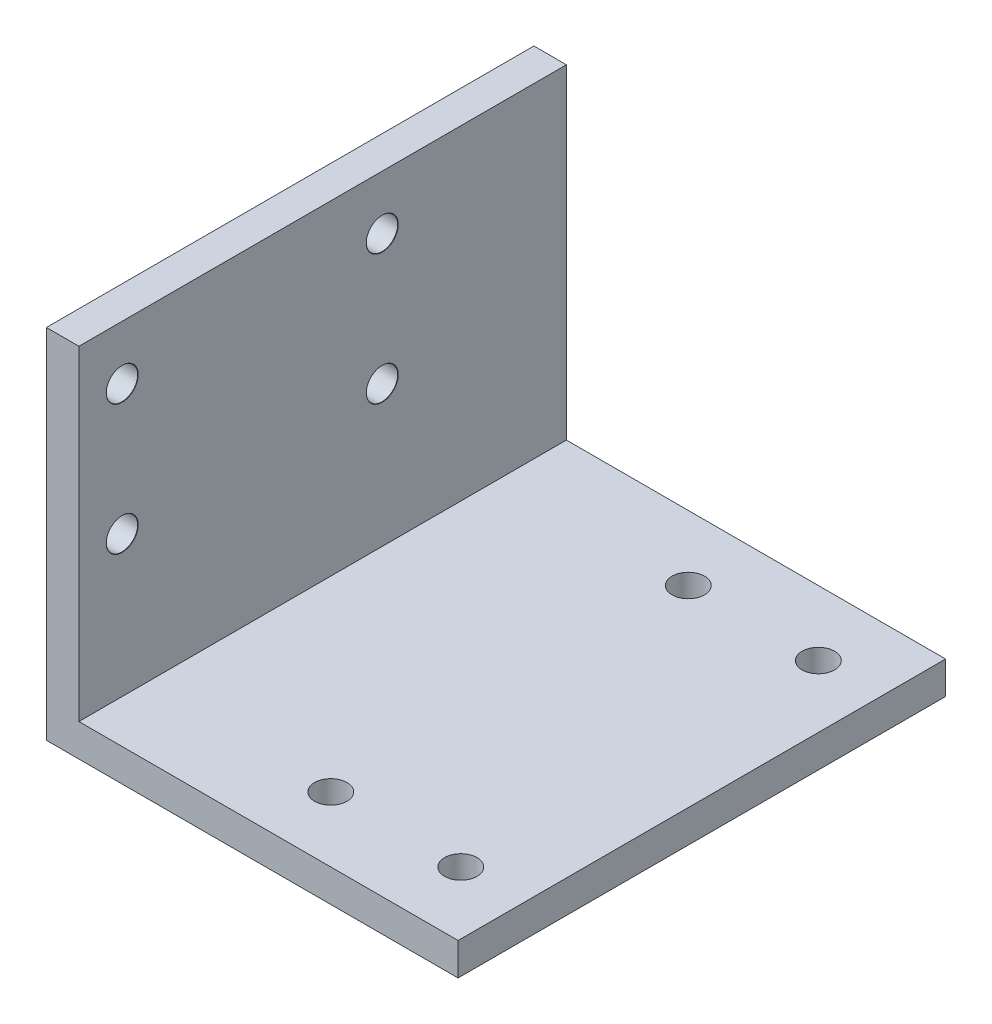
ISO-10303-21;
HEADER;
FILE_DESCRIPTION(('STEP AP214'),'2;1');
FILE_NAME('part.step','',(''),(''),'','','');
FILE_SCHEMA(('AUTOMOTIVE_DESIGN { 1 0 10303 214 1 1 1 1 }'));
ENDSEC;
DATA;
#1=APPLICATION_CONTEXT('core data for automotive mechanical design processes');
#2=APPLICATION_PROTOCOL_DEFINITION('international standard','automotive_design',2000,#1);
#3=PRODUCT_CONTEXT('',#1,'mechanical');
#4=PRODUCT('Part','Part','',(#3));
#5=PRODUCT_RELATED_PRODUCT_CATEGORY('part','',(#4));
#6=PRODUCT_DEFINITION_FORMATION('','',#4);
#7=PRODUCT_DEFINITION_CONTEXT('part definition',#1,'design');
#8=PRODUCT_DEFINITION('design','',#6,#7);
#9=PRODUCT_DEFINITION_SHAPE('','',#8);
#10=(LENGTH_UNIT() NAMED_UNIT(*) SI_UNIT(.MILLI.,.METRE.));
#11=(NAMED_UNIT(*) PLANE_ANGLE_UNIT() SI_UNIT($,.RADIAN.));
#12=(NAMED_UNIT(*) SI_UNIT($,.STERADIAN.) SOLID_ANGLE_UNIT());
#13=UNCERTAINTY_MEASURE_WITH_UNIT(LENGTH_MEASURE(1.E-05),#10,'distance_accuracy_value','');
#14=(GEOMETRIC_REPRESENTATION_CONTEXT(3) GLOBAL_UNCERTAINTY_ASSIGNED_CONTEXT((#13)) GLOBAL_UNIT_ASSIGNED_CONTEXT((#10,
#11,#12)) REPRESENTATION_CONTEXT('',''));
#15=CARTESIAN_POINT('',(0.,0.,0.));
#16=DIRECTION('',(0.,0.,1.));
#17=DIRECTION('',(1.,0.,0.));
#18=AXIS2_PLACEMENT_3D('',#15,#16,#17);
#19=CARTESIAN_POINT('',(-16.,33.,22.5));
#20=DIRECTION('',(-1.,0.,0.));
#21=DIRECTION('',(0.,0.,1.));
#22=AXIS2_PLACEMENT_3D('',#19,#20,#21);
#23=PLANE('',#22);
#24=CARTESIAN_POINT('',(-16.,16.,18.4999999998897));
#25=DIRECTION('',(1.,0.,0.));
#26=DIRECTION('',(0.,0.,-1.));
#27=AXIS2_PLACEMENT_3D('',#24,#25,#26);
#28=CIRCLE('',#27,1.475);
#29=CARTESIAN_POINT('',(-16.,16.,17.0249999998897));
#30=VERTEX_POINT('',#29);
#31=EDGE_CURVE('E497',#30,#30,#28,.T.);
#32=ORIENTED_EDGE('',*,*,#31,.F.);
#33=EDGE_LOOP('',(#32));
#34=FACE_BOUND('',#33,.T.);
#35=CARTESIAN_POINT('',(-16.,16.,-5.49999999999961));
#36=DIRECTION('',(1.,0.,0.));
#37=DIRECTION('',(0.,0.,-1.));
#38=AXIS2_PLACEMENT_3D('',#35,#36,#37);
#39=CIRCLE('',#38,1.475);
#40=CARTESIAN_POINT('',(-16.,16.,-6.97499999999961));
#41=VERTEX_POINT('',#40);
#42=EDGE_CURVE('E133',#41,#41,#39,.T.);
#43=ORIENTED_EDGE('',*,*,#42,.F.);
#44=EDGE_LOOP('',(#43));
#45=FACE_BOUND('',#44,.T.);
#46=CARTESIAN_POINT('',(-16.,28.,-5.50000000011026));
#47=DIRECTION('',(1.,0.,0.));
#48=DIRECTION('',(0.,0.,-1.));
#49=AXIS2_PLACEMENT_3D('',#46,#47,#48);
#50=CIRCLE('',#49,1.475);
#51=CARTESIAN_POINT('',(-16.,28.,-6.97500000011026));
#52=VERTEX_POINT('',#51);
#53=EDGE_CURVE('E126',#52,#52,#50,.T.);
#54=ORIENTED_EDGE('',*,*,#53,.F.);
#55=EDGE_LOOP('',(#54));
#56=FACE_BOUND('',#55,.T.);
#57=DIRECTION('',(0.,0.,-1.));
#58=VECTOR('',#57,1.);
#59=CARTESIAN_POINT('',(-16.,3.,22.5));
#60=LINE('',#59,#58);
#61=CARTESIAN_POINT('',(-16.,3.,22.5));
#62=VERTEX_POINT('',#61);
#63=CARTESIAN_POINT('',(-16.,3.,-22.5));
#64=VERTEX_POINT('',#63);
#65=EDGE_CURVE('E56',#62,#64,#60,.T.);
#66=ORIENTED_EDGE('',*,*,#65,.T.);
#67=DIRECTION('',(0.,-1.,0.));
#68=VECTOR('',#67,1.);
#69=CARTESIAN_POINT('',(-16.,33.,-22.5));
#70=LINE('',#69,#68);
#71=CARTESIAN_POINT('',(-16.,33.,-22.5));
#72=VERTEX_POINT('',#71);
#73=EDGE_CURVE('E163',#72,#64,#70,.T.);
#74=ORIENTED_EDGE('',*,*,#73,.F.);
#75=DIRECTION('',(0.,0.,-1.));
#76=VECTOR('',#75,1.);
#77=CARTESIAN_POINT('',(-16.,33.,22.5));
#78=LINE('',#77,#76);
#79=CARTESIAN_POINT('',(-16.,33.,22.5));
#80=VERTEX_POINT('',#79);
#81=EDGE_CURVE('E147',#80,#72,#78,.T.);
#82=ORIENTED_EDGE('',*,*,#81,.F.);
#83=DIRECTION('',(0.,-1.,0.));
#84=VECTOR('',#83,1.);
#85=CARTESIAN_POINT('',(-16.,33.,22.5));
#86=LINE('',#85,#84);
#87=EDGE_CURVE('E159',#80,#62,#86,.T.);
#88=ORIENTED_EDGE('',*,*,#87,.T.);
#89=EDGE_LOOP('',(#66,#74,#82,#88));
#90=FACE_BOUND('',#89,.T.);
#91=CARTESIAN_POINT('',(-16.,28.,18.4999999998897));
#92=DIRECTION('',(1.,0.,0.));
#93=DIRECTION('',(0.,0.,-1.));
#94=AXIS2_PLACEMENT_3D('',#91,#92,#93);
#95=CIRCLE('',#94,1.475);
#96=CARTESIAN_POINT('',(-16.,28.,17.0249999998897));
#97=VERTEX_POINT('',#96);
#98=EDGE_CURVE('E122',#97,#97,#95,.T.);
#99=ORIENTED_EDGE('',*,*,#98,.F.);
#100=EDGE_LOOP('',(#99));
#101=FACE_BOUND('',#100,.T.);
#102=ADVANCED_FACE('F39',(#34,#45,#56,#90,#101),#23,.F.);
#103=CARTESIAN_POINT('',(0.,3.,0.));
#104=DIRECTION('',(0.,-1.,0.));
#105=DIRECTION('',(0.,0.,-1.));
#106=AXIS2_PLACEMENT_3D('',#103,#104,#105);
#107=PLANE('',#106);
#108=CARTESIAN_POINT('',(1.25000000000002,3.,16.5));
#109=DIRECTION('',(0.,1.,0.));
#110=DIRECTION('',(0.,0.,-1.));
#111=AXIS2_PLACEMENT_3D('',#108,#109,#110);
#112=CIRCLE('',#111,1.5);
#113=CARTESIAN_POINT('',(1.25000000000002,3.,15.));
#114=VERTEX_POINT('',#113);
#115=EDGE_CURVE('E167',#114,#114,#112,.T.);
#116=ORIENTED_EDGE('',*,*,#115,.F.);
#117=EDGE_LOOP('',(#116));
#118=FACE_BOUND('',#117,.T.);
#119=CARTESIAN_POINT('',(13.25,3.,16.5));
#120=DIRECTION('',(0.,1.,0.));
#121=DIRECTION('',(0.,0.,-1.));
#122=AXIS2_PLACEMENT_3D('',#119,#120,#121);
#123=CIRCLE('',#122,1.5);
#124=CARTESIAN_POINT('',(13.25,3.,15.));
#125=VERTEX_POINT('',#124);
#126=EDGE_CURVE('E173',#125,#125,#123,.T.);
#127=ORIENTED_EDGE('',*,*,#126,.F.);
#128=EDGE_LOOP('',(#127));
#129=FACE_BOUND('',#128,.T.);
#130=CARTESIAN_POINT('',(1.25000000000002,3.,-16.5));
#131=DIRECTION('',(0.,1.,0.));
#132=DIRECTION('',(0.,0.,1.));
#133=AXIS2_PLACEMENT_3D('',#130,#131,#132);
#134=CIRCLE('',#133,1.5);
#135=CARTESIAN_POINT('',(1.25000000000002,3.,-15.));
#136=VERTEX_POINT('',#135);
#137=EDGE_CURVE('E179',#136,#136,#134,.T.);
#138=ORIENTED_EDGE('',*,*,#137,.F.);
#139=EDGE_LOOP('',(#138));
#140=FACE_BOUND('',#139,.T.);
#141=CARTESIAN_POINT('',(13.25,3.,-16.5));
#142=DIRECTION('',(0.,1.,0.));
#143=DIRECTION('',(0.,0.,1.));
#144=AXIS2_PLACEMENT_3D('',#141,#142,#143);
#145=CIRCLE('',#144,1.5);
#146=CARTESIAN_POINT('',(13.25,3.,-15.));
#147=VERTEX_POINT('',#146);
#148=EDGE_CURVE('E103',#147,#147,#145,.T.);
#149=ORIENTED_EDGE('',*,*,#148,.F.);
#150=EDGE_LOOP('',(#149));
#151=FACE_BOUND('',#150,.T.);
#152=ORIENTED_EDGE('',*,*,#65,.F.);
#153=DIRECTION('',(1.,0.,0.));
#154=VECTOR('',#153,1.);
#155=CARTESIAN_POINT('',(-19.,3.,22.5));
#156=LINE('',#155,#154);
#157=CARTESIAN_POINT('',(19.,3.,22.5));
#158=VERTEX_POINT('',#157);
#159=EDGE_CURVE('E61',#62,#158,#156,.T.);
#160=ORIENTED_EDGE('',*,*,#159,.T.);
#161=DIRECTION('',(0.,0.,-1.));
#162=VECTOR('',#161,1.);
#163=CARTESIAN_POINT('',(19.,3.,22.5));
#164=LINE('',#163,#162);
#165=CARTESIAN_POINT('',(19.,3.,-22.5));
#166=VERTEX_POINT('',#165);
#167=EDGE_CURVE('E92',#158,#166,#164,.T.);
#168=ORIENTED_EDGE('',*,*,#167,.T.);
#169=DIRECTION('',(-1.,0.,0.));
#170=VECTOR('',#169,1.);
#171=CARTESIAN_POINT('',(-19.,3.,-22.5));
#172=LINE('',#171,#170);
#173=EDGE_CURVE('E186',#166,#64,#172,.T.);
#174=ORIENTED_EDGE('',*,*,#173,.T.);
#175=EDGE_LOOP('',(#152,#160,#168,#174));
#176=FACE_BOUND('',#175,.T.);
#177=ADVANCED_FACE('F188',(#118,#129,#140,#151,#176),#107,.F.);
#178=CARTESIAN_POINT('',(0.,0.,0.));
#179=DIRECTION('',(0.,-1.,0.));
#180=DIRECTION('',(0.,0.,-1.));
#181=AXIS2_PLACEMENT_3D('',#178,#179,#180);
#182=PLANE('',#181);
#183=CARTESIAN_POINT('',(13.25,0.,16.5));
#184=DIRECTION('',(0.,1.,0.));
#185=DIRECTION('',(0.,0.,-1.));
#186=AXIS2_PLACEMENT_3D('',#183,#184,#185);
#187=CIRCLE('',#186,1.5);
#188=CARTESIAN_POINT('',(13.25,0.,15.));
#189=VERTEX_POINT('',#188);
#190=EDGE_CURVE('E170',#189,#189,#187,.T.);
#191=ORIENTED_EDGE('',*,*,#190,.T.);
#192=EDGE_LOOP('',(#191));
#193=FACE_BOUND('',#192,.T.);
#194=CARTESIAN_POINT('',(13.25,0.,-16.5));
#195=DIRECTION('',(0.,1.,0.));
#196=DIRECTION('',(0.,0.,1.));
#197=AXIS2_PLACEMENT_3D('',#194,#195,#196);
#198=CIRCLE('',#197,1.5);
#199=CARTESIAN_POINT('',(13.25,0.,-15.));
#200=VERTEX_POINT('',#199);
#201=EDGE_CURVE('E107',#200,#200,#198,.T.);
#202=ORIENTED_EDGE('',*,*,#201,.T.);
#203=EDGE_LOOP('',(#202));
#204=FACE_BOUND('',#203,.T.);
#205=DIRECTION('',(0.,0.,-1.));
#206=VECTOR('',#205,1.);
#207=CARTESIAN_POINT('',(19.,0.,22.5));
#208=LINE('',#207,#206);
#209=CARTESIAN_POINT('',(19.,0.,22.5));
#210=VERTEX_POINT('',#209);
#211=CARTESIAN_POINT('',(19.,0.,-22.5));
#212=VERTEX_POINT('',#211);
#213=EDGE_CURVE('E98',#210,#212,#208,.T.);
#214=ORIENTED_EDGE('',*,*,#213,.F.);
#215=DIRECTION('',(1.,0.,0.));
#216=VECTOR('',#215,1.);
#217=CARTESIAN_POINT('',(-19.,0.,22.5));
#218=LINE('',#217,#216);
#219=CARTESIAN_POINT('',(-19.,0.,22.5));
#220=VERTEX_POINT('',#219);
#221=EDGE_CURVE('E81',#220,#210,#218,.T.);
#222=ORIENTED_EDGE('',*,*,#221,.F.);
#223=DIRECTION('',(0.,0.,1.));
#224=VECTOR('',#223,1.);
#225=CARTESIAN_POINT('',(-19.,0.,22.5));
#226=LINE('',#225,#224);
#227=CARTESIAN_POINT('',(-19.,0.,-22.5));
#228=VERTEX_POINT('',#227);
#229=EDGE_CURVE('E93',#228,#220,#226,.T.);
#230=ORIENTED_EDGE('',*,*,#229,.F.);
#231=DIRECTION('',(-1.,0.,0.));
#232=VECTOR('',#231,1.);
#233=CARTESIAN_POINT('',(-19.,0.,-22.5));
#234=LINE('',#233,#232);
#235=EDGE_CURVE('E102',#212,#228,#234,.T.);
#236=ORIENTED_EDGE('',*,*,#235,.F.);
#237=EDGE_LOOP('',(#214,#222,#230,#236));
#238=FACE_BOUND('',#237,.T.);
#239=CARTESIAN_POINT('',(1.25000000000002,0.,-16.5));
#240=DIRECTION('',(0.,1.,0.));
#241=DIRECTION('',(0.,0.,1.));
#242=AXIS2_PLACEMENT_3D('',#239,#240,#241);
#243=CIRCLE('',#242,1.5);
#244=CARTESIAN_POINT('',(1.25000000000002,0.,-15.));
#245=VERTEX_POINT('',#244);
#246=EDGE_CURVE('E176',#245,#245,#243,.T.);
#247=ORIENTED_EDGE('',*,*,#246,.T.);
#248=EDGE_LOOP('',(#247));
#249=FACE_BOUND('',#248,.T.);
#250=CARTESIAN_POINT('',(1.25000000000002,0.,16.5));
#251=DIRECTION('',(0.,1.,0.));
#252=DIRECTION('',(0.,0.,-1.));
#253=AXIS2_PLACEMENT_3D('',#250,#251,#252);
#254=CIRCLE('',#253,1.5);
#255=CARTESIAN_POINT('',(1.25000000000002,0.,15.));
#256=VERTEX_POINT('',#255);
#257=EDGE_CURVE('E166',#256,#256,#254,.T.);
#258=ORIENTED_EDGE('',*,*,#257,.T.);
#259=EDGE_LOOP('',(#258));
#260=FACE_BOUND('',#259,.T.);
#261=ADVANCED_FACE('F100',(#193,#204,#238,#249,#260),#182,.T.);
#262=CARTESIAN_POINT('',(19.,3.,22.5));
#263=DIRECTION('',(-1.,0.,0.));
#264=DIRECTION('',(0.,0.,1.));
#265=AXIS2_PLACEMENT_3D('',#262,#263,#264);
#266=PLANE('',#265);
#267=ORIENTED_EDGE('',*,*,#213,.T.);
#268=DIRECTION('',(0.,-1.,0.));
#269=VECTOR('',#268,1.);
#270=CARTESIAN_POINT('',(19.,3.,-22.5));
#271=LINE('',#270,#269);
#272=EDGE_CURVE('E11',#166,#212,#271,.T.);
#273=ORIENTED_EDGE('',*,*,#272,.F.);
#274=ORIENTED_EDGE('',*,*,#167,.F.);
#275=DIRECTION('',(0.,-1.,0.));
#276=VECTOR('',#275,1.);
#277=CARTESIAN_POINT('',(19.,3.,22.5));
#278=LINE('',#277,#276);
#279=EDGE_CURVE('E84',#158,#210,#278,.T.);
#280=ORIENTED_EDGE('',*,*,#279,.T.);
#281=EDGE_LOOP('',(#267,#273,#274,#280));
#282=FACE_BOUND('',#281,.T.);
#283=ADVANCED_FACE('F41',(#282),#266,.F.);
#284=CARTESIAN_POINT('',(-19.,3.,-22.5));
#285=DIRECTION('',(0.,0.,1.));
#286=DIRECTION('',(1.,0.,0.));
#287=AXIS2_PLACEMENT_3D('',#284,#285,#286);
#288=PLANE('',#287);
#289=ORIENTED_EDGE('',*,*,#235,.T.);
#290=DIRECTION('',(0.,-1.,0.));
#291=VECTOR('',#290,1.);
#292=CARTESIAN_POINT('',(-19.,3.,-22.5));
#293=LINE('',#292,#291);
#294=CARTESIAN_POINT('',(-19.,33.,-22.5));
#295=VERTEX_POINT('',#294);
#296=EDGE_CURVE('E48',#295,#228,#293,.T.);
#297=ORIENTED_EDGE('',*,*,#296,.F.);
#298=DIRECTION('',(-1.,0.,0.));
#299=VECTOR('',#298,1.);
#300=CARTESIAN_POINT('',(-16.,33.,-22.5));
#301=LINE('',#300,#299);
#302=EDGE_CURVE('E150',#72,#295,#301,.T.);
#303=ORIENTED_EDGE('',*,*,#302,.F.);
#304=ORIENTED_EDGE('',*,*,#73,.T.);
#305=ORIENTED_EDGE('',*,*,#173,.F.);
#306=ORIENTED_EDGE('',*,*,#272,.T.);
#307=EDGE_LOOP('',(#289,#297,#303,#304,#305,#306));
#308=FACE_BOUND('',#307,.T.);
#309=ADVANCED_FACE('F193',(#308),#288,.F.);
#310=CARTESIAN_POINT('',(-19.,3.,22.5));
#311=DIRECTION('',(1.,0.,0.));
#312=DIRECTION('',(0.,0.,-1.));
#313=AXIS2_PLACEMENT_3D('',#310,#311,#312);
#314=PLANE('',#313);
#315=CARTESIAN_POINT('',(-19.,16.,18.4999999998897));
#316=DIRECTION('',(1.,0.,0.));
#317=DIRECTION('',(0.,0.,-1.));
#318=AXIS2_PLACEMENT_3D('',#315,#316,#317);
#319=CIRCLE('',#318,1.44999999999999);
#320=CARTESIAN_POINT('',(-19.,16.,17.0499999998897));
#321=VERTEX_POINT('',#320);
#322=EDGE_CURVE('E43',#321,#321,#319,.T.);
#323=ORIENTED_EDGE('',*,*,#322,.T.);
#324=EDGE_LOOP('',(#323));
#325=FACE_BOUND('',#324,.T.);
#326=CARTESIAN_POINT('',(-19.,16.,-5.49999999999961));
#327=DIRECTION('',(1.,0.,0.));
#328=DIRECTION('',(0.,0.,-1.));
#329=AXIS2_PLACEMENT_3D('',#326,#327,#328);
#330=CIRCLE('',#329,1.44999999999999);
#331=CARTESIAN_POINT('',(-19.,16.,-6.94999999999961));
#332=VERTEX_POINT('',#331);
#333=EDGE_CURVE('E124',#332,#332,#330,.T.);
#334=ORIENTED_EDGE('',*,*,#333,.T.);
#335=EDGE_LOOP('',(#334));
#336=FACE_BOUND('',#335,.T.);
#337=CARTESIAN_POINT('',(-19.,28.,-5.50000000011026));
#338=DIRECTION('',(1.,0.,0.));
#339=DIRECTION('',(0.,0.,-1.));
#340=AXIS2_PLACEMENT_3D('',#337,#338,#339);
#341=CIRCLE('',#340,1.44999999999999);
#342=CARTESIAN_POINT('',(-19.,28.,-6.95000000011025));
#343=VERTEX_POINT('',#342);
#344=EDGE_CURVE('E120',#343,#343,#341,.T.);
#345=ORIENTED_EDGE('',*,*,#344,.T.);
#346=EDGE_LOOP('',(#345));
#347=FACE_BOUND('',#346,.T.);
#348=CARTESIAN_POINT('',(-19.,28.,18.4999999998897));
#349=DIRECTION('',(1.,0.,0.));
#350=DIRECTION('',(0.,0.,-1.));
#351=AXIS2_PLACEMENT_3D('',#348,#349,#350);
#352=CIRCLE('',#351,1.44999999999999);
#353=CARTESIAN_POINT('',(-19.,28.,17.0499999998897));
#354=VERTEX_POINT('',#353);
#355=EDGE_CURVE('E116',#354,#354,#352,.T.);
#356=ORIENTED_EDGE('',*,*,#355,.T.);
#357=EDGE_LOOP('',(#356));
#358=FACE_BOUND('',#357,.T.);
#359=ORIENTED_EDGE('',*,*,#229,.T.);
#360=DIRECTION('',(0.,-1.,0.));
#361=VECTOR('',#360,1.);
#362=CARTESIAN_POINT('',(-19.,3.,22.5));
#363=LINE('',#362,#361);
#364=CARTESIAN_POINT('',(-19.,33.,22.5));
#365=VERTEX_POINT('',#364);
#366=EDGE_CURVE('E88',#365,#220,#363,.T.);
#367=ORIENTED_EDGE('',*,*,#366,.F.);
#368=DIRECTION('',(0.,0.,1.));
#369=VECTOR('',#368,1.);
#370=CARTESIAN_POINT('',(-19.,33.,22.5));
#371=LINE('',#370,#369);
#372=EDGE_CURVE('E153',#295,#365,#371,.T.);
#373=ORIENTED_EDGE('',*,*,#372,.F.);
#374=ORIENTED_EDGE('',*,*,#296,.T.);
#375=EDGE_LOOP('',(#359,#367,#373,#374));
#376=FACE_BOUND('',#375,.T.);
#377=ADVANCED_FACE('F209',(#325,#336,#347,#358,#376),#314,.F.);
#378=CARTESIAN_POINT('',(-19.,3.,22.5));
#379=DIRECTION('',(0.,0.,-1.));
#380=DIRECTION('',(-1.,0.,0.));
#381=AXIS2_PLACEMENT_3D('',#378,#379,#380);
#382=PLANE('',#381);
#383=ORIENTED_EDGE('',*,*,#221,.T.);
#384=ORIENTED_EDGE('',*,*,#279,.F.);
#385=ORIENTED_EDGE('',*,*,#159,.F.);
#386=ORIENTED_EDGE('',*,*,#87,.F.);
#387=DIRECTION('',(1.,0.,0.));
#388=VECTOR('',#387,1.);
#389=CARTESIAN_POINT('',(-16.,33.,22.5));
#390=LINE('',#389,#388);
#391=EDGE_CURVE('E156',#365,#80,#390,.T.);
#392=ORIENTED_EDGE('',*,*,#391,.F.);
#393=ORIENTED_EDGE('',*,*,#366,.T.);
#394=EDGE_LOOP('',(#383,#384,#385,#386,#392,#393));
#395=FACE_BOUND('',#394,.T.);
#396=ADVANCED_FACE('F83',(#395),#382,.F.);
#397=CARTESIAN_POINT('',(13.25,3.,-16.5));
#398=DIRECTION('',(0.,-1.,0.));
#399=DIRECTION('',(0.,0.,-1.));
#400=AXIS2_PLACEMENT_3D('',#397,#398,#399);
#401=CYLINDRICAL_SURFACE('',#400,1.5);
#402=ORIENTED_EDGE('',*,*,#148,.T.);
#403=EDGE_LOOP('',(#402));
#404=FACE_BOUND('',#403,.T.);
#405=ORIENTED_EDGE('',*,*,#201,.F.);
#406=EDGE_LOOP('',(#405));
#407=FACE_BOUND('',#406,.T.);
#408=ADVANCED_FACE('F217',(#404,#407),#401,.F.);
#409=CARTESIAN_POINT('',(1.25000000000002,3.,-16.5));
#410=DIRECTION('',(0.,-1.,0.));
#411=DIRECTION('',(0.,0.,-1.));
#412=AXIS2_PLACEMENT_3D('',#409,#410,#411);
#413=CYLINDRICAL_SURFACE('',#412,1.5);
#414=ORIENTED_EDGE('',*,*,#137,.T.);
#415=EDGE_LOOP('',(#414));
#416=FACE_BOUND('',#415,.T.);
#417=ORIENTED_EDGE('',*,*,#246,.F.);
#418=EDGE_LOOP('',(#417));
#419=FACE_BOUND('',#418,.T.);
#420=ADVANCED_FACE('F240',(#416,#419),#413,.F.);
#421=CARTESIAN_POINT('',(13.25,3.,16.5));
#422=DIRECTION('',(0.,-1.,0.));
#423=DIRECTION('',(0.,0.,-1.));
#424=AXIS2_PLACEMENT_3D('',#421,#422,#423);
#425=CYLINDRICAL_SURFACE('',#424,1.5);
#426=ORIENTED_EDGE('',*,*,#126,.T.);
#427=EDGE_LOOP('',(#426));
#428=FACE_BOUND('',#427,.T.);
#429=ORIENTED_EDGE('',*,*,#190,.F.);
#430=EDGE_LOOP('',(#429));
#431=FACE_BOUND('',#430,.T.);
#432=ADVANCED_FACE('F236',(#428,#431),#425,.F.);
#433=CARTESIAN_POINT('',(1.25000000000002,3.,16.5));
#434=DIRECTION('',(0.,-1.,0.));
#435=DIRECTION('',(0.,0.,-1.));
#436=AXIS2_PLACEMENT_3D('',#433,#434,#435);
#437=CYLINDRICAL_SURFACE('',#436,1.5);
#438=ORIENTED_EDGE('',*,*,#115,.T.);
#439=EDGE_LOOP('',(#438));
#440=FACE_BOUND('',#439,.T.);
#441=ORIENTED_EDGE('',*,*,#257,.F.);
#442=EDGE_LOOP('',(#441));
#443=FACE_BOUND('',#442,.T.);
#444=ADVANCED_FACE('F233',(#440,#443),#437,.F.);
#445=CARTESIAN_POINT('',(0.,33.,0.));
#446=DIRECTION('',(0.,1.,0.));
#447=DIRECTION('',(0.,0.,1.));
#448=AXIS2_PLACEMENT_3D('',#445,#446,#447);
#449=PLANE('',#448);
#450=ORIENTED_EDGE('',*,*,#81,.T.);
#451=ORIENTED_EDGE('',*,*,#302,.T.);
#452=ORIENTED_EDGE('',*,*,#372,.T.);
#453=ORIENTED_EDGE('',*,*,#391,.T.);
#454=EDGE_LOOP('',(#450,#451,#452,#453));
#455=FACE_BOUND('',#454,.T.);
#456=ADVANCED_FACE('F208',(#455),#449,.T.);
#457=CARTESIAN_POINT('',(-16.,28.,18.4999999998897));
#458=DIRECTION('',(1.,0.,0.));
#459=DIRECTION('',(0.,0.,-1.));
#460=AXIS2_PLACEMENT_3D('',#457,#458,#459);
#461=CYLINDRICAL_SURFACE('',#460,1.44999999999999);
#462=CARTESIAN_POINT('',(-16.025,28.,18.4999999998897));
#463=DIRECTION('',(1.,0.,0.));
#464=DIRECTION('',(0.,0.,-1.));
#465=AXIS2_PLACEMENT_3D('',#462,#463,#464);
#466=CIRCLE('',#465,1.44999999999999);
#467=CARTESIAN_POINT('',(-16.025,28.,17.0499999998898));
#468=VERTEX_POINT('',#467);
#469=EDGE_CURVE('E119',#468,#468,#466,.T.);
#470=ORIENTED_EDGE('',*,*,#469,.T.);
#471=EDGE_LOOP('',(#470));
#472=FACE_BOUND('',#471,.T.);
#473=ORIENTED_EDGE('',*,*,#355,.F.);
#474=EDGE_LOOP('',(#473));
#475=FACE_BOUND('',#474,.T.);
#476=ADVANCED_FACE('F310',(#472,#475),#461,.F.);
#477=CARTESIAN_POINT('',(-16.,28.,18.4999999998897));
#478=DIRECTION('',(1.,0.,0.));
#479=DIRECTION('',(0.,0.,-1.));
#480=AXIS2_PLACEMENT_3D('',#477,#478,#479);
#481=CONICAL_SURFACE('',#480,1.475,0.785398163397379);
#482=ORIENTED_EDGE('',*,*,#469,.F.);
#483=EDGE_LOOP('',(#482));
#484=FACE_BOUND('',#483,.T.);
#485=ORIENTED_EDGE('',*,*,#98,.T.);
#486=EDGE_LOOP('',(#485));
#487=FACE_BOUND('',#486,.T.);
#488=ADVANCED_FACE('F317',(#484,#487),#481,.F.);
#489=CARTESIAN_POINT('',(-16.,28.,-5.50000000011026));
#490=DIRECTION('',(1.,0.,0.));
#491=DIRECTION('',(0.,0.,-1.));
#492=AXIS2_PLACEMENT_3D('',#489,#490,#491);
#493=CYLINDRICAL_SURFACE('',#492,1.44999999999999);
#494=CARTESIAN_POINT('',(-16.025,28.,-5.50000000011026));
#495=DIRECTION('',(1.,0.,0.));
#496=DIRECTION('',(0.,0.,-1.));
#497=AXIS2_PLACEMENT_3D('',#494,#495,#496);
#498=CIRCLE('',#497,1.44999999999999);
#499=CARTESIAN_POINT('',(-16.025,28.,-6.95000000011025));
#500=VERTEX_POINT('',#499);
#501=EDGE_CURVE('E123',#500,#500,#498,.T.);
#502=ORIENTED_EDGE('',*,*,#501,.T.);
#503=EDGE_LOOP('',(#502));
#504=FACE_BOUND('',#503,.T.);
#505=ORIENTED_EDGE('',*,*,#344,.F.);
#506=EDGE_LOOP('',(#505));
#507=FACE_BOUND('',#506,.T.);
#508=ADVANCED_FACE('F326',(#504,#507),#493,.F.);
#509=CARTESIAN_POINT('',(-16.,28.,-5.50000000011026));
#510=DIRECTION('',(1.,0.,0.));
#511=DIRECTION('',(0.,0.,-1.));
#512=AXIS2_PLACEMENT_3D('',#509,#510,#511);
#513=CONICAL_SURFACE('',#512,1.475,0.785398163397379);
#514=ORIENTED_EDGE('',*,*,#501,.F.);
#515=EDGE_LOOP('',(#514));
#516=FACE_BOUND('',#515,.T.);
#517=ORIENTED_EDGE('',*,*,#53,.T.);
#518=EDGE_LOOP('',(#517));
#519=FACE_BOUND('',#518,.T.);
#520=ADVANCED_FACE('F336',(#516,#519),#513,.F.);
#521=CARTESIAN_POINT('',(-16.,16.,-5.49999999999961));
#522=DIRECTION('',(1.,0.,0.));
#523=DIRECTION('',(0.,0.,-1.));
#524=AXIS2_PLACEMENT_3D('',#521,#522,#523);
#525=CYLINDRICAL_SURFACE('',#524,1.44999999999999);
#526=CARTESIAN_POINT('',(-16.025,16.,-5.49999999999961));
#527=DIRECTION('',(1.,0.,0.));
#528=DIRECTION('',(0.,0.,-1.));
#529=AXIS2_PLACEMENT_3D('',#526,#527,#528);
#530=CIRCLE('',#529,1.44999999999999);
#531=CARTESIAN_POINT('',(-16.025,16.,-6.9499999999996));
#532=VERTEX_POINT('',#531);
#533=EDGE_CURVE('E127',#532,#532,#530,.T.);
#534=ORIENTED_EDGE('',*,*,#533,.T.);
#535=EDGE_LOOP('',(#534));
#536=FACE_BOUND('',#535,.T.);
#537=ORIENTED_EDGE('',*,*,#333,.F.);
#538=EDGE_LOOP('',(#537));
#539=FACE_BOUND('',#538,.T.);
#540=ADVANCED_FACE('F346',(#536,#539),#525,.F.);
#541=CARTESIAN_POINT('',(-16.,16.,-5.49999999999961));
#542=DIRECTION('',(1.,0.,0.));
#543=DIRECTION('',(0.,0.,-1.));
#544=AXIS2_PLACEMENT_3D('',#541,#542,#543);
#545=CONICAL_SURFACE('',#544,1.475,0.785398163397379);
#546=ORIENTED_EDGE('',*,*,#533,.F.);
#547=EDGE_LOOP('',(#546));
#548=FACE_BOUND('',#547,.T.);
#549=ORIENTED_EDGE('',*,*,#42,.T.);
#550=EDGE_LOOP('',(#549));
#551=FACE_BOUND('',#550,.T.);
#552=ADVANCED_FACE('F356',(#548,#551),#545,.F.);
#553=CARTESIAN_POINT('',(-16.,16.,18.4999999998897));
#554=DIRECTION('',(1.,0.,0.));
#555=DIRECTION('',(0.,0.,-1.));
#556=AXIS2_PLACEMENT_3D('',#553,#554,#555);
#557=CYLINDRICAL_SURFACE('',#556,1.44999999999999);
#558=CARTESIAN_POINT('',(-16.025,16.,18.4999999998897));
#559=DIRECTION('',(1.,0.,0.));
#560=DIRECTION('',(0.,0.,-1.));
#561=AXIS2_PLACEMENT_3D('',#558,#559,#560);
#562=CIRCLE('',#561,1.44999999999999);
#563=CARTESIAN_POINT('',(-16.025,16.,17.0499999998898));
#564=VERTEX_POINT('',#563);
#565=EDGE_CURVE('E495',#564,#564,#562,.T.);
#566=ORIENTED_EDGE('',*,*,#565,.T.);
#567=EDGE_LOOP('',(#566));
#568=FACE_BOUND('',#567,.T.);
#569=ORIENTED_EDGE('',*,*,#322,.F.);
#570=EDGE_LOOP('',(#569));
#571=FACE_BOUND('',#570,.T.);
#572=ADVANCED_FACE('F365',(#568,#571),#557,.F.);
#573=CARTESIAN_POINT('',(-16.,16.,18.4999999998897));
#574=DIRECTION('',(1.,0.,0.));
#575=DIRECTION('',(0.,0.,-1.));
#576=AXIS2_PLACEMENT_3D('',#573,#574,#575);
#577=CONICAL_SURFACE('',#576,1.475,0.785398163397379);
#578=ORIENTED_EDGE('',*,*,#565,.F.);
#579=EDGE_LOOP('',(#578));
#580=FACE_BOUND('',#579,.T.);
#581=ORIENTED_EDGE('',*,*,#31,.T.);
#582=EDGE_LOOP('',(#581));
#583=FACE_BOUND('',#582,.T.);
#584=ADVANCED_FACE('F375',(#580,#583),#577,.F.);
#585=CLOSED_SHELL('',(#102,#177,#261,#283,#309,#377,#396,#408,#420,#432,#444,#456,#476,#488,
#508,#520,#540,#552,#572,#584));
#586=MANIFOLD_SOLID_BREP('B2',#585);
#587=ADVANCED_BREP_SHAPE_REPRESENTATION('',(#18,#586),#14);
#588=SHAPE_DEFINITION_REPRESENTATION(#9,#587);
ENDSEC;
END-ISO-10303-21;
